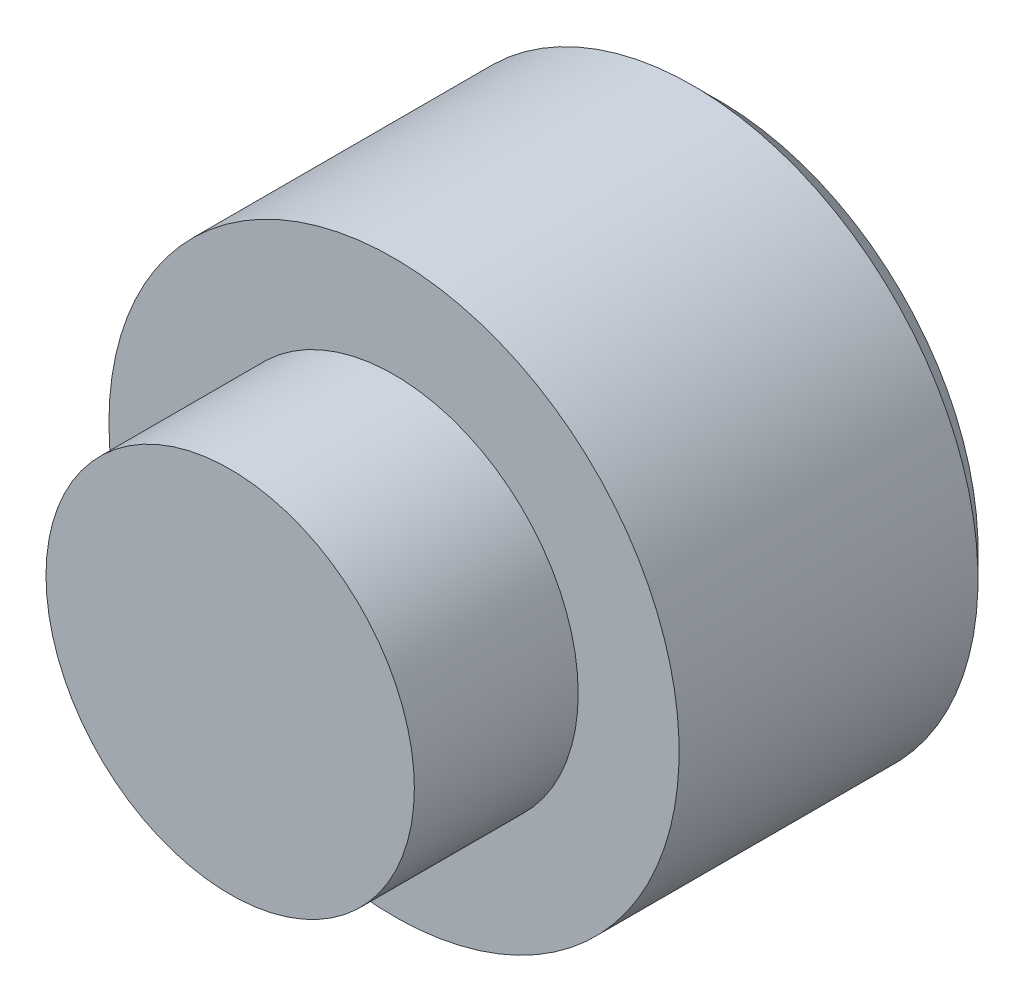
ISO-10303-21;
HEADER;
FILE_DESCRIPTION(('STEP AP214'),'2;1');
FILE_NAME('part.step','',(''),(''),'','','');
FILE_SCHEMA(('AUTOMOTIVE_DESIGN { 1 0 10303 214 1 1 1 1 }'));
ENDSEC;
DATA;
#1=APPLICATION_CONTEXT('core data for automotive mechanical design processes');
#2=APPLICATION_PROTOCOL_DEFINITION('international standard','automotive_design',2000,#1);
#3=PRODUCT_CONTEXT('',#1,'mechanical');
#4=PRODUCT('Part','Part','',(#3));
#5=PRODUCT_RELATED_PRODUCT_CATEGORY('part','',(#4));
#6=PRODUCT_DEFINITION_FORMATION('','',#4);
#7=PRODUCT_DEFINITION_CONTEXT('part definition',#1,'design');
#8=PRODUCT_DEFINITION('design','',#6,#7);
#9=PRODUCT_DEFINITION_SHAPE('','',#8);
#10=(LENGTH_UNIT() NAMED_UNIT(*) SI_UNIT(.MILLI.,.METRE.));
#11=(NAMED_UNIT(*) PLANE_ANGLE_UNIT() SI_UNIT($,.RADIAN.));
#12=(NAMED_UNIT(*) SI_UNIT($,.STERADIAN.) SOLID_ANGLE_UNIT());
#13=UNCERTAINTY_MEASURE_WITH_UNIT(LENGTH_MEASURE(1.E-05),#10,'distance_accuracy_value','');
#14=(GEOMETRIC_REPRESENTATION_CONTEXT(3) GLOBAL_UNCERTAINTY_ASSIGNED_CONTEXT((#13)) GLOBAL_UNIT_ASSIGNED_CONTEXT((#10,
#11,#12)) REPRESENTATION_CONTEXT('',''));
#15=CARTESIAN_POINT('',(0.,0.,0.));
#16=DIRECTION('',(0.,0.,1.));
#17=DIRECTION('',(1.,0.,0.));
#18=AXIS2_PLACEMENT_3D('',#15,#16,#17);
#19=CARTESIAN_POINT('',(0.,0.,3.175));
#20=DIRECTION('',(0.,0.,-1.));
#21=DIRECTION('',(-1.,0.,0.));
#22=AXIS2_PLACEMENT_3D('',#19,#20,#21);
#23=CYLINDRICAL_SURFACE('',#22,3.5687);
#24=CARTESIAN_POINT('',(0.,0.,3.175));
#25=DIRECTION('',(0.,0.,1.));
#26=DIRECTION('',(1.,0.,0.));
#27=AXIS2_PLACEMENT_3D('',#24,#25,#26);
#28=CIRCLE('',#27,3.5687);
#29=CARTESIAN_POINT('',(3.5687,0.,3.175));
#30=VERTEX_POINT('',#29);
#31=EDGE_CURVE('E46',#30,#30,#28,.T.);
#32=ORIENTED_EDGE('',*,*,#31,.F.);
#33=EDGE_LOOP('',(#32));
#34=FACE_BOUND('',#33,.T.);
#35=CARTESIAN_POINT('',(0.,0.,0.));
#36=DIRECTION('',(0.,0.,-1.));
#37=DIRECTION('',(-1.,0.,0.));
#38=AXIS2_PLACEMENT_3D('',#35,#36,#37);
#39=CIRCLE('',#38,3.5687);
#40=CARTESIAN_POINT('',(-3.5687,0.,0.));
#41=VERTEX_POINT('',#40);
#42=EDGE_CURVE('E50',#41,#41,#39,.T.);
#43=ORIENTED_EDGE('',*,*,#42,.F.);
#44=EDGE_LOOP('',(#43));
#45=FACE_BOUND('',#44,.T.);
#46=ADVANCED_FACE('F35',(#34,#45),#23,.T.);
#47=CARTESIAN_POINT('',(0.,0.,3.175));
#48=DIRECTION('',(0.,0.,1.));
#49=DIRECTION('',(1.,0.,0.));
#50=AXIS2_PLACEMENT_3D('',#47,#48,#49);
#51=PLANE('',#50);
#52=ORIENTED_EDGE('',*,*,#31,.T.);
#53=EDGE_LOOP('',(#52));
#54=FACE_BOUND('',#53,.T.);
#55=ADVANCED_FACE('F64',(#54),#51,.T.);
#56=CARTESIAN_POINT('',(0.,0.,0.));
#57=DIRECTION('',(0.,0.,-1.));
#58=DIRECTION('',(-1.,0.,0.));
#59=AXIS2_PLACEMENT_3D('',#56,#57,#58);
#60=PLANE('',#59);
#61=CARTESIAN_POINT('',(0.,0.,0.));
#62=DIRECTION('',(0.,0.,-1.));
#63=DIRECTION('',(-1.,0.,0.));
#64=AXIS2_PLACEMENT_3D('',#61,#62,#63);
#65=CIRCLE('',#64,5.5245);
#66=CARTESIAN_POINT('',(-5.5245,0.,0.));
#67=VERTEX_POINT('',#66);
#68=EDGE_CURVE('E55',#67,#67,#65,.T.);
#69=ORIENTED_EDGE('',*,*,#68,.F.);
#70=EDGE_LOOP('',(#69));
#71=FACE_BOUND('',#70,.T.);
#72=ORIENTED_EDGE('',*,*,#42,.T.);
#73=EDGE_LOOP('',(#72));
#74=FACE_BOUND('',#73,.T.);
#75=ADVANCED_FACE('F61',(#71,#74),#60,.F.);
#76=CARTESIAN_POINT('',(0.,0.,-6.2992));
#77=DIRECTION('',(0.,0.,1.));
#78=DIRECTION('',(1.,0.,0.));
#79=AXIS2_PLACEMENT_3D('',#76,#77,#78);
#80=CYLINDRICAL_SURFACE('',#79,5.5245);
#81=CARTESIAN_POINT('',(0.,0.,-5.7912));
#82=DIRECTION('',(0.,0.,-1.));
#83=DIRECTION('',(-1.,0.,0.));
#84=AXIS2_PLACEMENT_3D('',#81,#82,#83);
#85=CIRCLE('',#84,5.5245);
#86=CARTESIAN_POINT('',(-5.5245,0.,-5.7912));
#87=VERTEX_POINT('',#86);
#88=EDGE_CURVE('E10',#87,#87,#85,.F.);
#89=ORIENTED_EDGE('',*,*,#88,.T.);
#90=EDGE_LOOP('',(#89));
#91=FACE_BOUND('',#90,.T.);
#92=ORIENTED_EDGE('',*,*,#68,.T.);
#93=EDGE_LOOP('',(#92));
#94=FACE_BOUND('',#93,.T.);
#95=ADVANCED_FACE('F59',(#91,#94),#80,.T.);
#96=CARTESIAN_POINT('',(0.,0.,-6.2992));
#97=DIRECTION('',(0.,0.,-1.));
#98=DIRECTION('',(-1.,0.,0.));
#99=AXIS2_PLACEMENT_3D('',#96,#97,#98);
#100=PLANE('',#99);
#101=CARTESIAN_POINT('',(0.,0.,-6.2992));
#102=DIRECTION('',(0.,0.,-1.));
#103=DIRECTION('',(-1.,0.,0.));
#104=AXIS2_PLACEMENT_3D('',#101,#102,#103);
#105=CIRCLE('',#104,5.0165);
#106=CARTESIAN_POINT('',(-5.0165,0.,-6.2992));
#107=VERTEX_POINT('',#106);
#108=EDGE_CURVE('E42',#107,#107,#105,.T.);
#109=ORIENTED_EDGE('',*,*,#108,.T.);
#110=EDGE_LOOP('',(#109));
#111=FACE_BOUND('',#110,.T.);
#112=ADVANCED_FACE('F78',(#111),#100,.T.);
#113=CARTESIAN_POINT('',(0.,0.,-6.2992));
#114=DIRECTION('',(0.,0.,1.));
#115=DIRECTION('',(1.,0.,0.));
#116=AXIS2_PLACEMENT_3D('',#113,#114,#115);
#117=CONICAL_SURFACE('',#116,5.0165,0.785398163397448);
#118=ORIENTED_EDGE('',*,*,#88,.F.);
#119=EDGE_LOOP('',(#118));
#120=FACE_BOUND('',#119,.T.);
#121=ORIENTED_EDGE('',*,*,#108,.F.);
#122=EDGE_LOOP('',(#121));
#123=FACE_BOUND('',#122,.T.);
#124=ADVANCED_FACE('F37',(#120,#123),#117,.T.);
#125=CLOSED_SHELL('',(#46,#55,#75,#95,#112,#124));
#126=MANIFOLD_SOLID_BREP('B2',#125);
#127=ADVANCED_BREP_SHAPE_REPRESENTATION('',(#18,#126),#14);
#128=SHAPE_DEFINITION_REPRESENTATION(#9,#127);
ENDSEC;
END-ISO-10303-21;
